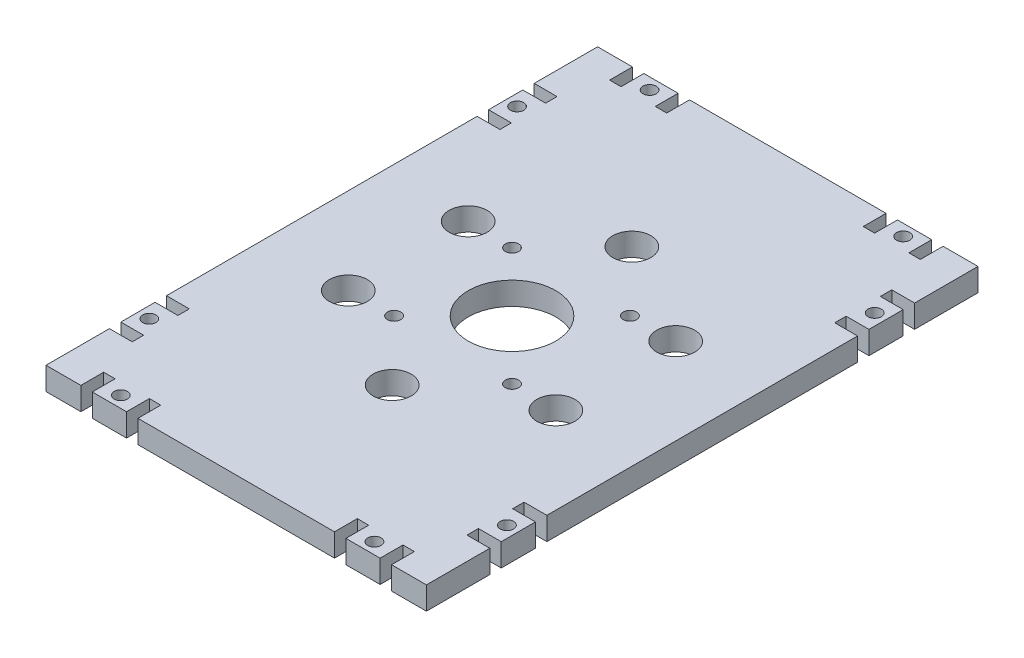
from build123d import *

# Parameters (mm, degrees)
SKETCH1_W           = 100
SKETCH1_H           = 145
BOSS_EXTRUDE1_DEPTH = 6
SKETCH2_R           = 1.75
SKETCH2_W           = 6
SKETCH2_H           = 3
SKETCH2_W_2         = 3
SKETCH2_H_2         = 6
CUT_EXTRUDE1_DEPTH  = 89.273722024
SKETCH3_R           = 11.5
SKETCH3_R_2         = 1.75
CUT_EXTRUDE2_DEPTH  = 89.273722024
SKETCH5_R           = 5
CUT_EXTRUDE3_DEPTH  = 89.273722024


with BuildPart() as part:
    # Sketch1 → Boss-Extrude1 (new body)
    with BuildSketch(Plane(origin=(0, 0, 0), x_dir=(1, 0, 0), z_dir=(0, 1, 0))):
        Rectangle(SKETCH1_W, SKETCH1_H)
    extrude(amount=BOSS_EXTRUDE1_DEPTH)

    # Sketch2 → Cut-Extrude1 (cut, through all)
    with BuildSketch(Plane(origin=(0, 6, 0), x_dir=(1, 0, 0), z_dir=(0, 1, 0))):
        with Locations(Location((-33.333333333, 69.5, 0), (0, 0, 270))):
            Circle(SKETCH2_R)
        with Locations(Location((-47, 48.333333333, 0), (0, 0, 270))):
            Circle(SKETCH2_R)
        with Locations(Location((47, 48.333333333, 0), (0, 0, 90))):
            Circle(SKETCH2_R)
        with Locations(Location((33.333333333, 69.5, 0), (0, 0, 90))):
            Circle(SKETCH2_R)
        with Locations(Location((47, -48.333333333, 0), (0, 0, 270))):
            Circle(SKETCH2_R)
        with Locations(Location((33.333333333, -69.5, 0), (0, 0, 270))):
            Circle(SKETCH2_R)
        with Locations(Location((-47, -48.333333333, 0), (0, 0, 90))):
            Circle(SKETCH2_R)
        with Locations(Location((-33.333333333, -69.5, 0), (0, 0, 90))):
            Circle(SKETCH2_R)
        with Locations((-47, 54.333333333)):
            Rectangle(SKETCH2_W, SKETCH2_H)
        with Locations((-39.333333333, 69.5)):
            Rectangle(SKETCH2_W_2, SKETCH2_H_2)
        with Locations((-27.333333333, 69.5)):
            Rectangle(SKETCH2_W_2, SKETCH2_H_2)
        with Locations((-47, 42.333333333)):
            Rectangle(SKETCH2_W, SKETCH2_H)
        with Locations((47, 42.333333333)):
            Rectangle(SKETCH2_W, SKETCH2_H)
        with Locations((47, 54.333333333)):
            Rectangle(SKETCH2_W, SKETCH2_H)
        with Locations((39.333333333, 69.5)):
            Rectangle(SKETCH2_W_2, SKETCH2_H_2)
        with Locations((27.333333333, 69.5)):
            Rectangle(SKETCH2_W_2, SKETCH2_H_2)
        with Locations((47, -42.333333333)):
            Rectangle(SKETCH2_W, SKETCH2_H)
        with Locations((47, -54.333333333)):
            Rectangle(SKETCH2_W, SKETCH2_H)
        with Locations((39.333333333, -69.5)):
            Rectangle(SKETCH2_W_2, SKETCH2_H_2)
        with Locations((27.333333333, -69.5)):
            Rectangle(SKETCH2_W_2, SKETCH2_H_2)
        with Locations((-47, -42.333333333)):
            Rectangle(SKETCH2_W, SKETCH2_H)
        with Locations((-47, -54.333333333)):
            Rectangle(SKETCH2_W, SKETCH2_H)
        with Locations((-39.333333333, -69.5)):
            Rectangle(SKETCH2_W_2, SKETCH2_H_2)
        with Locations((-27.333333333, -69.5)):
            Rectangle(SKETCH2_W_2, SKETCH2_H_2)
    extrude(amount=-CUT_EXTRUDE1_DEPTH, mode=Mode.SUBTRACT)

    # Sketch3 → Cut-Extrude2 (cut, through all)
    with BuildSketch(Plane(origin=(0, 6, 0), x_dir=(1, 0, 0), z_dir=(0, 1, 0))):
        with Locations(Location((0, 0, 0), (0, 0, 270))):
            Circle(SKETCH3_R)
        with Locations(Location((15.5, 15.5, 0), (0, 0, 270))):
            Circle(SKETCH3_R_2)
        with Locations(Location((-15.5, 15.5, 0), (0, 0, 270))):
            Circle(SKETCH3_R_2)
        with Locations(Location((-15.5, -15.5, 0), (0, 0, 90))):
            Circle(SKETCH3_R_2)
        with Locations(Location((15.5, -15.5, 0), (0, 0, 90))):
            Circle(SKETCH3_R_2)
    extrude(amount=-CUT_EXTRUDE2_DEPTH, mode=Mode.SUBTRACT)

    # Sketch5 → Cut-Extrude3 (cut, through all)
    with BuildSketch(Plane(origin=(0, 6, 0), x_dir=(1, 0, 0), z_dir=(0, 1, 0))):
        with Locations(Location((0, 31.5, 0), (0, 0, 270))):
            Circle(SKETCH5_R)
        with Locations(Location((27.279800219, 15.75, 0), (0, 0, 270))):
            Circle(SKETCH5_R)
        with Locations(Location((27.279800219, -15.75, 0), (0, 0, 270))):
            Circle(SKETCH5_R)
        with Locations(Location((0, -31.5, 0), (0, 0, 270))):
            Circle(SKETCH5_R)
        with Locations(Location((-27.279800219, -15.75, 0), (0, 0, 270))):
            Circle(SKETCH5_R)
        with Locations(Location((-27.279800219, 15.75, 0), (0, 0, 270))):
            Circle(SKETCH5_R)
    extrude(amount=-CUT_EXTRUDE3_DEPTH, mode=Mode.SUBTRACT)


solid = part.part
